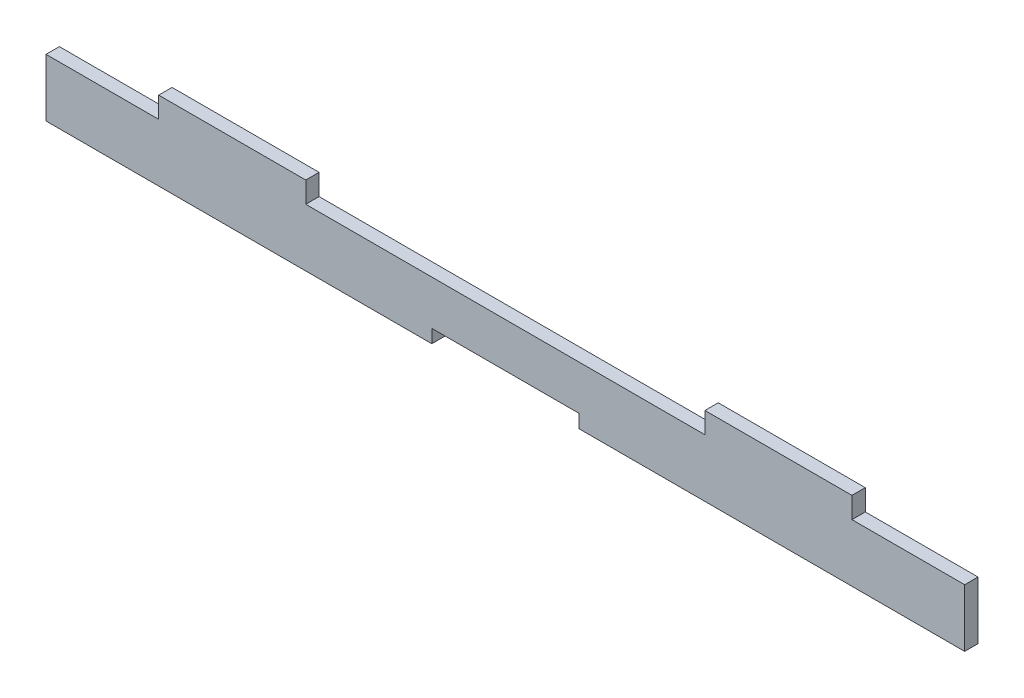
ISO-10303-21;
HEADER;
FILE_DESCRIPTION(('STEP AP214'),'2;1');
FILE_NAME('part.step','',(''),(''),'','','');
FILE_SCHEMA(('AUTOMOTIVE_DESIGN { 1 0 10303 214 1 1 1 1 }'));
ENDSEC;
DATA;
#1=APPLICATION_CONTEXT('core data for automotive mechanical design processes');
#2=APPLICATION_PROTOCOL_DEFINITION('international standard','automotive_design',2000,#1);
#3=PRODUCT_CONTEXT('',#1,'mechanical');
#4=PRODUCT('Part','Part','',(#3));
#5=PRODUCT_RELATED_PRODUCT_CATEGORY('part','',(#4));
#6=PRODUCT_DEFINITION_FORMATION('','',#4);
#7=PRODUCT_DEFINITION_CONTEXT('part definition',#1,'design');
#8=PRODUCT_DEFINITION('design','',#6,#7);
#9=PRODUCT_DEFINITION_SHAPE('','',#8);
#10=(LENGTH_UNIT() NAMED_UNIT(*) SI_UNIT(.MILLI.,.METRE.));
#11=(NAMED_UNIT(*) PLANE_ANGLE_UNIT() SI_UNIT($,.RADIAN.));
#12=(NAMED_UNIT(*) SI_UNIT($,.STERADIAN.) SOLID_ANGLE_UNIT());
#13=UNCERTAINTY_MEASURE_WITH_UNIT(LENGTH_MEASURE(1.E-05),#10,'distance_accuracy_value','');
#14=(GEOMETRIC_REPRESENTATION_CONTEXT(3) GLOBAL_UNCERTAINTY_ASSIGNED_CONTEXT((#13)) GLOBAL_UNIT_ASSIGNED_CONTEXT((#10,
#11,#12)) REPRESENTATION_CONTEXT('',''));
#15=CARTESIAN_POINT('',(0.,0.,0.));
#16=DIRECTION('',(0.,0.,1.));
#17=DIRECTION('',(1.,0.,0.));
#18=AXIS2_PLACEMENT_3D('',#15,#16,#17);
#19=CARTESIAN_POINT('',(-35.,-13.75,6.35));
#20=DIRECTION('',(-1.,0.,0.));
#21=DIRECTION('',(0.,0.,1.));
#22=AXIS2_PLACEMENT_3D('',#19,#20,#21);
#23=PLANE('',#22);
#24=DIRECTION('',(0.,1.,0.));
#25=VECTOR('',#24,1.);
#26=CARTESIAN_POINT('',(-35.,-13.75,0.));
#27=LINE('',#26,#25);
#28=CARTESIAN_POINT('',(-35.,-13.75,0.));
#29=VERTEX_POINT('',#28);
#30=CARTESIAN_POINT('',(-35.,-7.39999999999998,0.));
#31=VERTEX_POINT('',#30);
#32=EDGE_CURVE('E181',#29,#31,#27,.T.);
#33=ORIENTED_EDGE('',*,*,#32,.T.);
#34=DIRECTION('',(0.,0.,-1.));
#35=VECTOR('',#34,1.);
#36=CARTESIAN_POINT('',(-35.,-7.39999999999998,6.35));
#37=LINE('',#36,#35);
#38=CARTESIAN_POINT('',(-35.,-7.39999999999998,6.35));
#39=VERTEX_POINT('',#38);
#40=EDGE_CURVE('E11',#39,#31,#37,.T.);
#41=ORIENTED_EDGE('',*,*,#40,.F.);
#42=DIRECTION('',(0.,1.,0.));
#43=VECTOR('',#42,1.);
#44=CARTESIAN_POINT('',(-35.,-13.75,6.35));
#45=LINE('',#44,#43);
#46=CARTESIAN_POINT('',(-35.,-13.75,6.35));
#47=VERTEX_POINT('',#46);
#48=EDGE_CURVE('E211',#47,#39,#45,.T.);
#49=ORIENTED_EDGE('',*,*,#48,.F.);
#50=DIRECTION('',(0.,0.,-1.));
#51=VECTOR('',#50,1.);
#52=CARTESIAN_POINT('',(-35.,-13.75,6.35));
#53=LINE('',#52,#51);
#54=EDGE_CURVE('E177',#47,#29,#53,.T.);
#55=ORIENTED_EDGE('',*,*,#54,.T.);
#56=EDGE_LOOP('',(#33,#41,#49,#55));
#57=FACE_BOUND('',#56,.T.);
#58=ADVANCED_FACE('F37',(#57),#23,.F.);
#59=CARTESIAN_POINT('',(-35.,-7.39999999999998,6.35));
#60=DIRECTION('',(0.,1.,0.));
#61=DIRECTION('',(-1.,0.,0.));
#62=AXIS2_PLACEMENT_3D('',#59,#60,#61);
#63=PLANE('',#62);
#64=DIRECTION('',(1.,0.,0.));
#65=VECTOR('',#64,1.);
#66=CARTESIAN_POINT('',(-35.,-7.39999999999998,0.));
#67=LINE('',#66,#65);
#68=CARTESIAN_POINT('',(35.,-7.39999999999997,0.));
#69=VERTEX_POINT('',#68);
#70=EDGE_CURVE('E184',#31,#69,#67,.T.);
#71=ORIENTED_EDGE('',*,*,#70,.T.);
#72=DIRECTION('',(0.,0.,-1.));
#73=VECTOR('',#72,1.);
#74=CARTESIAN_POINT('',(35.,-7.39999999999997,6.35));
#75=LINE('',#74,#73);
#76=CARTESIAN_POINT('',(35.,-7.39999999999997,6.35));
#77=VERTEX_POINT('',#76);
#78=EDGE_CURVE('E45',#77,#69,#75,.T.);
#79=ORIENTED_EDGE('',*,*,#78,.F.);
#80=DIRECTION('',(1.,0.,0.));
#81=VECTOR('',#80,1.);
#82=CARTESIAN_POINT('',(-35.,-7.39999999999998,6.35));
#83=LINE('',#82,#81);
#84=EDGE_CURVE('E120',#39,#77,#83,.T.);
#85=ORIENTED_EDGE('',*,*,#84,.F.);
#86=ORIENTED_EDGE('',*,*,#40,.T.);
#87=EDGE_LOOP('',(#71,#79,#85,#86));
#88=FACE_BOUND('',#87,.T.);
#89=ADVANCED_FACE('F309',(#88),#63,.F.);
#90=CARTESIAN_POINT('',(35.,-13.75,6.35));
#91=DIRECTION('',(1.,0.,0.));
#92=DIRECTION('',(0.,0.,-1.));
#93=AXIS2_PLACEMENT_3D('',#90,#91,#92);
#94=PLANE('',#93);
#95=DIRECTION('',(0.,-1.,0.));
#96=VECTOR('',#95,1.);
#97=CARTESIAN_POINT('',(35.,-13.75,0.));
#98=LINE('',#97,#96);
#99=CARTESIAN_POINT('',(35.,-13.75,0.));
#100=VERTEX_POINT('',#99);
#101=EDGE_CURVE('E186',#69,#100,#98,.T.);
#102=ORIENTED_EDGE('',*,*,#101,.T.);
#103=DIRECTION('',(0.,0.,-1.));
#104=VECTOR('',#103,1.);
#105=CARTESIAN_POINT('',(35.,-13.75,6.35));
#106=LINE('',#105,#104);
#107=CARTESIAN_POINT('',(35.,-13.75,6.35));
#108=VERTEX_POINT('',#107);
#109=EDGE_CURVE('E242',#108,#100,#106,.T.);
#110=ORIENTED_EDGE('',*,*,#109,.F.);
#111=DIRECTION('',(0.,-1.,0.));
#112=VECTOR('',#111,1.);
#113=CARTESIAN_POINT('',(35.,-13.75,6.35));
#114=LINE('',#113,#112);
#115=EDGE_CURVE('E250',#77,#108,#114,.T.);
#116=ORIENTED_EDGE('',*,*,#115,.F.);
#117=ORIENTED_EDGE('',*,*,#78,.T.);
#118=EDGE_LOOP('',(#102,#110,#116,#117));
#119=FACE_BOUND('',#118,.T.);
#120=ADVANCED_FACE('F248',(#119),#94,.F.);
#121=CARTESIAN_POINT('',(35.,-13.75,6.35));
#122=DIRECTION('',(0.,1.,0.));
#123=DIRECTION('',(0.,0.,1.));
#124=AXIS2_PLACEMENT_3D('',#121,#122,#123);
#125=PLANE('',#124);
#126=DIRECTION('',(1.,0.,0.));
#127=VECTOR('',#126,1.);
#128=CARTESIAN_POINT('',(35.,-13.75,0.));
#129=LINE('',#128,#127);
#130=CARTESIAN_POINT('',(218.65,-13.75,0.));
#131=VERTEX_POINT('',#130);
#132=EDGE_CURVE('E188',#100,#131,#129,.T.);
#133=ORIENTED_EDGE('',*,*,#132,.T.);
#134=DIRECTION('',(0.,0.,-1.));
#135=VECTOR('',#134,1.);
#136=CARTESIAN_POINT('',(218.65,-13.75,6.35));
#137=LINE('',#136,#135);
#138=CARTESIAN_POINT('',(218.65,-13.75,6.35));
#139=VERTEX_POINT('',#138);
#140=EDGE_CURVE('E239',#139,#131,#137,.T.);
#141=ORIENTED_EDGE('',*,*,#140,.F.);
#142=DIRECTION('',(1.,0.,0.));
#143=VECTOR('',#142,1.);
#144=CARTESIAN_POINT('',(35.,-13.75,6.35));
#145=LINE('',#144,#143);
#146=EDGE_CURVE('E268',#108,#139,#145,.T.);
#147=ORIENTED_EDGE('',*,*,#146,.F.);
#148=ORIENTED_EDGE('',*,*,#109,.T.);
#149=EDGE_LOOP('',(#133,#141,#147,#148));
#150=FACE_BOUND('',#149,.T.);
#151=ADVANCED_FACE('F259',(#150),#125,.F.);
#152=CARTESIAN_POINT('',(218.65,13.75,6.35));
#153=DIRECTION('',(-1.,0.,0.));
#154=DIRECTION('',(0.,0.,1.));
#155=AXIS2_PLACEMENT_3D('',#152,#153,#154);
#156=PLANE('',#155);
#157=DIRECTION('',(0.,1.,0.));
#158=VECTOR('',#157,1.);
#159=CARTESIAN_POINT('',(218.65,13.75,0.));
#160=LINE('',#159,#158);
#161=CARTESIAN_POINT('',(218.65,13.75,0.));
#162=VERTEX_POINT('',#161);
#163=EDGE_CURVE('E190',#131,#162,#160,.T.);
#164=ORIENTED_EDGE('',*,*,#163,.T.);
#165=DIRECTION('',(0.,0.,-1.));
#166=VECTOR('',#165,1.);
#167=CARTESIAN_POINT('',(218.65,13.75,6.35));
#168=LINE('',#167,#166);
#169=CARTESIAN_POINT('',(218.65,13.75,6.35));
#170=VERTEX_POINT('',#169);
#171=EDGE_CURVE('E236',#170,#162,#168,.T.);
#172=ORIENTED_EDGE('',*,*,#171,.F.);
#173=DIRECTION('',(0.,1.,0.));
#174=VECTOR('',#173,1.);
#175=CARTESIAN_POINT('',(218.65,13.75,6.35));
#176=LINE('',#175,#174);
#177=EDGE_CURVE('E265',#139,#170,#176,.T.);
#178=ORIENTED_EDGE('',*,*,#177,.F.);
#179=ORIENTED_EDGE('',*,*,#140,.T.);
#180=EDGE_LOOP('',(#164,#172,#178,#179));
#181=FACE_BOUND('',#180,.T.);
#182=ADVANCED_FACE('F263',(#181),#156,.F.);
#183=CARTESIAN_POINT('',(165.,13.75,6.35));
#184=DIRECTION('',(0.,-1.,0.));
#185=DIRECTION('',(0.,0.,-1.));
#186=AXIS2_PLACEMENT_3D('',#183,#184,#185);
#187=PLANE('',#186);
#188=DIRECTION('',(-1.,0.,0.));
#189=VECTOR('',#188,1.);
#190=CARTESIAN_POINT('',(165.,13.75,0.));
#191=LINE('',#190,#189);
#192=CARTESIAN_POINT('',(165.,13.75,0.));
#193=VERTEX_POINT('',#192);
#194=EDGE_CURVE('E192',#162,#193,#191,.T.);
#195=ORIENTED_EDGE('',*,*,#194,.T.);
#196=DIRECTION('',(0.,0.,-1.));
#197=VECTOR('',#196,1.);
#198=CARTESIAN_POINT('',(165.,13.75,6.35));
#199=LINE('',#198,#197);
#200=CARTESIAN_POINT('',(165.,13.75,6.35));
#201=VERTEX_POINT('',#200);
#202=EDGE_CURVE('E233',#201,#193,#199,.T.);
#203=ORIENTED_EDGE('',*,*,#202,.F.);
#204=DIRECTION('',(-1.,0.,0.));
#205=VECTOR('',#204,1.);
#206=CARTESIAN_POINT('',(165.,13.75,6.35));
#207=LINE('',#206,#205);
#208=EDGE_CURVE('E267',#170,#201,#207,.T.);
#209=ORIENTED_EDGE('',*,*,#208,.F.);
#210=ORIENTED_EDGE('',*,*,#171,.T.);
#211=EDGE_LOOP('',(#195,#203,#209,#210));
#212=FACE_BOUND('',#211,.T.);
#213=ADVANCED_FACE('F322',(#212),#187,.F.);
#214=CARTESIAN_POINT('',(165.,13.75,6.35));
#215=DIRECTION('',(-1.,0.,0.));
#216=DIRECTION('',(0.,-1.,0.));
#217=AXIS2_PLACEMENT_3D('',#214,#215,#216);
#218=PLANE('',#217);
#219=DIRECTION('',(0.,1.,0.));
#220=VECTOR('',#219,1.);
#221=CARTESIAN_POINT('',(165.,13.75,0.));
#222=LINE('',#221,#220);
#223=CARTESIAN_POINT('',(165.,23.75,0.));
#224=VERTEX_POINT('',#223);
#225=EDGE_CURVE('E194',#193,#224,#222,.T.);
#226=ORIENTED_EDGE('',*,*,#225,.T.);
#227=DIRECTION('',(0.,0.,-1.));
#228=VECTOR('',#227,1.);
#229=CARTESIAN_POINT('',(165.,23.75,6.35));
#230=LINE('',#229,#228);
#231=CARTESIAN_POINT('',(165.,23.75,6.35));
#232=VERTEX_POINT('',#231);
#233=EDGE_CURVE('E230',#232,#224,#230,.T.);
#234=ORIENTED_EDGE('',*,*,#233,.F.);
#235=DIRECTION('',(0.,1.,0.));
#236=VECTOR('',#235,1.);
#237=CARTESIAN_POINT('',(165.,13.75,6.35));
#238=LINE('',#237,#236);
#239=EDGE_CURVE('E270',#201,#232,#238,.T.);
#240=ORIENTED_EDGE('',*,*,#239,.F.);
#241=ORIENTED_EDGE('',*,*,#202,.T.);
#242=EDGE_LOOP('',(#226,#234,#240,#241));
#243=FACE_BOUND('',#242,.T.);
#244=ADVANCED_FACE('F325',(#243),#218,.F.);
#245=CARTESIAN_POINT('',(95.,23.75,6.35));
#246=DIRECTION('',(0.,-1.,0.));
#247=DIRECTION('',(0.,0.,-1.));
#248=AXIS2_PLACEMENT_3D('',#245,#246,#247);
#249=PLANE('',#248);
#250=DIRECTION('',(-1.,0.,0.));
#251=VECTOR('',#250,1.);
#252=CARTESIAN_POINT('',(95.,23.75,0.));
#253=LINE('',#252,#251);
#254=CARTESIAN_POINT('',(95.,23.75,0.));
#255=VERTEX_POINT('',#254);
#256=EDGE_CURVE('E196',#224,#255,#253,.T.);
#257=ORIENTED_EDGE('',*,*,#256,.T.);
#258=DIRECTION('',(0.,0.,-1.));
#259=VECTOR('',#258,1.);
#260=CARTESIAN_POINT('',(95.,23.75,6.35));
#261=LINE('',#260,#259);
#262=CARTESIAN_POINT('',(95.,23.75,6.35));
#263=VERTEX_POINT('',#262);
#264=EDGE_CURVE('E227',#263,#255,#261,.T.);
#265=ORIENTED_EDGE('',*,*,#264,.F.);
#266=DIRECTION('',(-1.,0.,0.));
#267=VECTOR('',#266,1.);
#268=CARTESIAN_POINT('',(95.,23.75,6.35));
#269=LINE('',#268,#267);
#270=EDGE_CURVE('E276',#232,#263,#269,.T.);
#271=ORIENTED_EDGE('',*,*,#270,.F.);
#272=ORIENTED_EDGE('',*,*,#233,.T.);
#273=EDGE_LOOP('',(#257,#265,#271,#272));
#274=FACE_BOUND('',#273,.T.);
#275=ADVANCED_FACE('F329',(#274),#249,.F.);
#276=CARTESIAN_POINT('',(95.,13.75,6.35));
#277=DIRECTION('',(1.,0.,0.));
#278=DIRECTION('',(0.,0.,-1.));
#279=AXIS2_PLACEMENT_3D('',#276,#277,#278);
#280=PLANE('',#279);
#281=DIRECTION('',(0.,-1.,0.));
#282=VECTOR('',#281,1.);
#283=CARTESIAN_POINT('',(95.,13.75,0.));
#284=LINE('',#283,#282);
#285=CARTESIAN_POINT('',(95.,13.75,0.));
#286=VERTEX_POINT('',#285);
#287=EDGE_CURVE('E198',#255,#286,#284,.T.);
#288=ORIENTED_EDGE('',*,*,#287,.T.);
#289=DIRECTION('',(0.,0.,-1.));
#290=VECTOR('',#289,1.);
#291=CARTESIAN_POINT('',(95.,13.75,6.35));
#292=LINE('',#291,#290);
#293=CARTESIAN_POINT('',(95.,13.75,6.35));
#294=VERTEX_POINT('',#293);
#295=EDGE_CURVE('E224',#294,#286,#292,.T.);
#296=ORIENTED_EDGE('',*,*,#295,.F.);
#297=DIRECTION('',(0.,-1.,0.));
#298=VECTOR('',#297,1.);
#299=CARTESIAN_POINT('',(95.,13.75,6.35));
#300=LINE('',#299,#298);
#301=EDGE_CURVE('E278',#263,#294,#300,.T.);
#302=ORIENTED_EDGE('',*,*,#301,.F.);
#303=ORIENTED_EDGE('',*,*,#264,.T.);
#304=EDGE_LOOP('',(#288,#296,#302,#303));
#305=FACE_BOUND('',#304,.T.);
#306=ADVANCED_FACE('F333',(#305),#280,.F.);
#307=CARTESIAN_POINT('',(-95.,13.75,6.35));
#308=DIRECTION('',(0.,-1.,0.));
#309=DIRECTION('',(0.,0.,-1.));
#310=AXIS2_PLACEMENT_3D('',#307,#308,#309);
#311=PLANE('',#310);
#312=DIRECTION('',(-1.,0.,0.));
#313=VECTOR('',#312,1.);
#314=CARTESIAN_POINT('',(-95.,13.75,0.));
#315=LINE('',#314,#313);
#316=CARTESIAN_POINT('',(-95.,13.75,0.));
#317=VERTEX_POINT('',#316);
#318=EDGE_CURVE('E200',#286,#317,#315,.T.);
#319=ORIENTED_EDGE('',*,*,#318,.T.);
#320=DIRECTION('',(0.,0.,-1.));
#321=VECTOR('',#320,1.);
#322=CARTESIAN_POINT('',(-95.,13.75,6.35));
#323=LINE('',#322,#321);
#324=CARTESIAN_POINT('',(-95.,13.75,6.35));
#325=VERTEX_POINT('',#324);
#326=EDGE_CURVE('E221',#325,#317,#323,.T.);
#327=ORIENTED_EDGE('',*,*,#326,.F.);
#328=DIRECTION('',(-1.,0.,0.));
#329=VECTOR('',#328,1.);
#330=CARTESIAN_POINT('',(-95.,13.75,6.35));
#331=LINE('',#330,#329);
#332=EDGE_CURVE('E280',#294,#325,#331,.T.);
#333=ORIENTED_EDGE('',*,*,#332,.F.);
#334=ORIENTED_EDGE('',*,*,#295,.T.);
#335=EDGE_LOOP('',(#319,#327,#333,#334));
#336=FACE_BOUND('',#335,.T.);
#337=ADVANCED_FACE('F337',(#336),#311,.F.);
#338=CARTESIAN_POINT('',(-95.,13.75,6.35));
#339=DIRECTION('',(-1.,0.,0.));
#340=DIRECTION('',(0.,0.,1.));
#341=AXIS2_PLACEMENT_3D('',#338,#339,#340);
#342=PLANE('',#341);
#343=DIRECTION('',(0.,1.,0.));
#344=VECTOR('',#343,1.);
#345=CARTESIAN_POINT('',(-95.,13.75,0.));
#346=LINE('',#345,#344);
#347=CARTESIAN_POINT('',(-95.,23.75,0.));
#348=VERTEX_POINT('',#347);
#349=EDGE_CURVE('E202',#317,#348,#346,.T.);
#350=ORIENTED_EDGE('',*,*,#349,.T.);
#351=DIRECTION('',(0.,0.,-1.));
#352=VECTOR('',#351,1.);
#353=CARTESIAN_POINT('',(-95.,23.75,6.35));
#354=LINE('',#353,#352);
#355=CARTESIAN_POINT('',(-95.,23.75,6.35));
#356=VERTEX_POINT('',#355);
#357=EDGE_CURVE('E218',#356,#348,#354,.T.);
#358=ORIENTED_EDGE('',*,*,#357,.F.);
#359=DIRECTION('',(0.,1.,0.));
#360=VECTOR('',#359,1.);
#361=CARTESIAN_POINT('',(-95.,13.75,6.35));
#362=LINE('',#361,#360);
#363=EDGE_CURVE('E282',#325,#356,#362,.T.);
#364=ORIENTED_EDGE('',*,*,#363,.F.);
#365=ORIENTED_EDGE('',*,*,#326,.T.);
#366=EDGE_LOOP('',(#350,#358,#364,#365));
#367=FACE_BOUND('',#366,.T.);
#368=ADVANCED_FACE('F341',(#367),#342,.F.);
#369=CARTESIAN_POINT('',(-165.,23.75,6.35));
#370=DIRECTION('',(0.,-1.,0.));
#371=DIRECTION('',(0.,0.,-1.));
#372=AXIS2_PLACEMENT_3D('',#369,#370,#371);
#373=PLANE('',#372);
#374=DIRECTION('',(-1.,0.,0.));
#375=VECTOR('',#374,1.);
#376=CARTESIAN_POINT('',(-165.,23.75,0.));
#377=LINE('',#376,#375);
#378=CARTESIAN_POINT('',(-165.,23.75,0.));
#379=VERTEX_POINT('',#378);
#380=EDGE_CURVE('E204',#348,#379,#377,.T.);
#381=ORIENTED_EDGE('',*,*,#380,.T.);
#382=DIRECTION('',(0.,0.,-1.));
#383=VECTOR('',#382,1.);
#384=CARTESIAN_POINT('',(-165.,23.75,6.35));
#385=LINE('',#384,#383);
#386=CARTESIAN_POINT('',(-165.,23.75,6.35));
#387=VERTEX_POINT('',#386);
#388=EDGE_CURVE('E215',#387,#379,#385,.T.);
#389=ORIENTED_EDGE('',*,*,#388,.F.);
#390=DIRECTION('',(-1.,0.,0.));
#391=VECTOR('',#390,1.);
#392=CARTESIAN_POINT('',(-165.,23.75,6.35));
#393=LINE('',#392,#391);
#394=EDGE_CURVE('E284',#356,#387,#393,.T.);
#395=ORIENTED_EDGE('',*,*,#394,.F.);
#396=ORIENTED_EDGE('',*,*,#357,.T.);
#397=EDGE_LOOP('',(#381,#389,#395,#396));
#398=FACE_BOUND('',#397,.T.);
#399=ADVANCED_FACE('F290',(#398),#373,.F.);
#400=CARTESIAN_POINT('',(-165.,13.75,6.35));
#401=DIRECTION('',(1.,0.,0.));
#402=DIRECTION('',(0.,1.,0.));
#403=AXIS2_PLACEMENT_3D('',#400,#401,#402);
#404=PLANE('',#403);
#405=DIRECTION('',(0.,-1.,0.));
#406=VECTOR('',#405,1.);
#407=CARTESIAN_POINT('',(-165.,13.75,0.));
#408=LINE('',#407,#406);
#409=CARTESIAN_POINT('',(-165.,13.75,0.));
#410=VERTEX_POINT('',#409);
#411=EDGE_CURVE('E206',#379,#410,#408,.T.);
#412=ORIENTED_EDGE('',*,*,#411,.T.);
#413=DIRECTION('',(0.,0.,-1.));
#414=VECTOR('',#413,1.);
#415=CARTESIAN_POINT('',(-165.,13.75,6.35));
#416=LINE('',#415,#414);
#417=CARTESIAN_POINT('',(-165.,13.75,6.35));
#418=VERTEX_POINT('',#417);
#419=EDGE_CURVE('E172',#418,#410,#416,.T.);
#420=ORIENTED_EDGE('',*,*,#419,.F.);
#421=DIRECTION('',(0.,-1.,0.));
#422=VECTOR('',#421,1.);
#423=CARTESIAN_POINT('',(-165.,13.75,6.35));
#424=LINE('',#423,#422);
#425=EDGE_CURVE('E163',#387,#418,#424,.T.);
#426=ORIENTED_EDGE('',*,*,#425,.F.);
#427=ORIENTED_EDGE('',*,*,#388,.T.);
#428=EDGE_LOOP('',(#412,#420,#426,#427));
#429=FACE_BOUND('',#428,.T.);
#430=ADVANCED_FACE('F294',(#429),#404,.F.);
#431=CARTESIAN_POINT('',(-218.65,13.75,6.35));
#432=DIRECTION('',(0.,-1.,0.));
#433=DIRECTION('',(1.,0.,0.));
#434=AXIS2_PLACEMENT_3D('',#431,#432,#433);
#435=PLANE('',#434);
#436=DIRECTION('',(-1.,0.,0.));
#437=VECTOR('',#436,1.);
#438=CARTESIAN_POINT('',(-218.65,13.75,0.));
#439=LINE('',#438,#437);
#440=CARTESIAN_POINT('',(-218.65,13.75,0.));
#441=VERTEX_POINT('',#440);
#442=EDGE_CURVE('E171',#410,#441,#439,.T.);
#443=ORIENTED_EDGE('',*,*,#442,.T.);
#444=DIRECTION('',(0.,0.,-1.));
#445=VECTOR('',#444,1.);
#446=CARTESIAN_POINT('',(-218.65,13.75,6.35));
#447=LINE('',#446,#445);
#448=CARTESIAN_POINT('',(-218.65,13.75,6.35));
#449=VERTEX_POINT('',#448);
#450=EDGE_CURVE('E168',#449,#441,#447,.T.);
#451=ORIENTED_EDGE('',*,*,#450,.F.);
#452=DIRECTION('',(-1.,0.,0.));
#453=VECTOR('',#452,1.);
#454=CARTESIAN_POINT('',(-218.65,13.75,6.35));
#455=LINE('',#454,#453);
#456=EDGE_CURVE('E157',#418,#449,#455,.T.);
#457=ORIENTED_EDGE('',*,*,#456,.F.);
#458=ORIENTED_EDGE('',*,*,#419,.T.);
#459=EDGE_LOOP('',(#443,#451,#457,#458));
#460=FACE_BOUND('',#459,.T.);
#461=ADVANCED_FACE('F169',(#460),#435,.F.);
#462=CARTESIAN_POINT('',(-218.65,13.75,6.35));
#463=DIRECTION('',(1.,0.,0.));
#464=DIRECTION('',(0.,0.,-1.));
#465=AXIS2_PLACEMENT_3D('',#462,#463,#464);
#466=PLANE('',#465);
#467=DIRECTION('',(0.,-1.,0.));
#468=VECTOR('',#467,1.);
#469=CARTESIAN_POINT('',(-218.65,13.75,0.));
#470=LINE('',#469,#468);
#471=CARTESIAN_POINT('',(-218.65,-13.75,0.));
#472=VERTEX_POINT('',#471);
#473=EDGE_CURVE('E106',#441,#472,#470,.T.);
#474=ORIENTED_EDGE('',*,*,#473,.T.);
#475=DIRECTION('',(0.,0.,-1.));
#476=VECTOR('',#475,1.);
#477=CARTESIAN_POINT('',(-218.65,-13.75,6.35));
#478=LINE('',#477,#476);
#479=CARTESIAN_POINT('',(-218.65,-13.75,6.35));
#480=VERTEX_POINT('',#479);
#481=EDGE_CURVE('E173',#480,#472,#478,.T.);
#482=ORIENTED_EDGE('',*,*,#481,.F.);
#483=DIRECTION('',(0.,-1.,0.));
#484=VECTOR('',#483,1.);
#485=CARTESIAN_POINT('',(-218.65,13.75,6.35));
#486=LINE('',#485,#484);
#487=EDGE_CURVE('E161',#449,#480,#486,.T.);
#488=ORIENTED_EDGE('',*,*,#487,.F.);
#489=ORIENTED_EDGE('',*,*,#450,.T.);
#490=EDGE_LOOP('',(#474,#482,#488,#489));
#491=FACE_BOUND('',#490,.T.);
#492=ADVANCED_FACE('F175',(#491),#466,.F.);
#493=CARTESIAN_POINT('',(-218.65,-13.75,6.35));
#494=DIRECTION('',(0.,1.,0.));
#495=DIRECTION('',(-1.,0.,0.));
#496=AXIS2_PLACEMENT_3D('',#493,#494,#495);
#497=PLANE('',#496);
#498=DIRECTION('',(1.,0.,0.));
#499=VECTOR('',#498,1.);
#500=CARTESIAN_POINT('',(-218.65,-13.75,0.));
#501=LINE('',#500,#499);
#502=EDGE_CURVE('E112',#472,#29,#501,.T.);
#503=ORIENTED_EDGE('',*,*,#502,.T.);
#504=ORIENTED_EDGE('',*,*,#54,.F.);
#505=DIRECTION('',(1.,0.,0.));
#506=VECTOR('',#505,1.);
#507=CARTESIAN_POINT('',(-218.65,-13.75,6.35));
#508=LINE('',#507,#506);
#509=EDGE_CURVE('E53',#480,#47,#508,.T.);
#510=ORIENTED_EDGE('',*,*,#509,.F.);
#511=ORIENTED_EDGE('',*,*,#481,.T.);
#512=EDGE_LOOP('',(#503,#504,#510,#511));
#513=FACE_BOUND('',#512,.T.);
#514=ADVANCED_FACE('F298',(#513),#497,.F.);
#515=CARTESIAN_POINT('',(0.,0.,6.35));
#516=DIRECTION('',(0.,0.,-1.));
#517=DIRECTION('',(-1.,0.,0.));
#518=AXIS2_PLACEMENT_3D('',#515,#516,#517);
#519=PLANE('',#518);
#520=ORIENTED_EDGE('',*,*,#48,.T.);
#521=ORIENTED_EDGE('',*,*,#84,.T.);
#522=ORIENTED_EDGE('',*,*,#115,.T.);
#523=ORIENTED_EDGE('',*,*,#146,.T.);
#524=ORIENTED_EDGE('',*,*,#177,.T.);
#525=ORIENTED_EDGE('',*,*,#208,.T.);
#526=ORIENTED_EDGE('',*,*,#239,.T.);
#527=ORIENTED_EDGE('',*,*,#270,.T.);
#528=ORIENTED_EDGE('',*,*,#301,.T.);
#529=ORIENTED_EDGE('',*,*,#332,.T.);
#530=ORIENTED_EDGE('',*,*,#363,.T.);
#531=ORIENTED_EDGE('',*,*,#394,.T.);
#532=ORIENTED_EDGE('',*,*,#425,.T.);
#533=ORIENTED_EDGE('',*,*,#456,.T.);
#534=ORIENTED_EDGE('',*,*,#487,.T.);
#535=ORIENTED_EDGE('',*,*,#509,.T.);
#536=EDGE_LOOP('',(#520,#521,#522,#523,#524,#525,#526,#527,#528,#529,#530,#531,#532,#533,#534,#535));
#537=FACE_BOUND('',#536,.T.);
#538=ADVANCED_FACE('F159',(#537),#519,.F.);
#539=CARTESIAN_POINT('',(0.,0.,0.));
#540=DIRECTION('',(0.,0.,-1.));
#541=DIRECTION('',(-1.,0.,0.));
#542=AXIS2_PLACEMENT_3D('',#539,#540,#541);
#543=PLANE('',#542);
#544=ORIENTED_EDGE('',*,*,#32,.F.);
#545=ORIENTED_EDGE('',*,*,#502,.F.);
#546=ORIENTED_EDGE('',*,*,#473,.F.);
#547=ORIENTED_EDGE('',*,*,#442,.F.);
#548=ORIENTED_EDGE('',*,*,#411,.F.);
#549=ORIENTED_EDGE('',*,*,#380,.F.);
#550=ORIENTED_EDGE('',*,*,#349,.F.);
#551=ORIENTED_EDGE('',*,*,#318,.F.);
#552=ORIENTED_EDGE('',*,*,#287,.F.);
#553=ORIENTED_EDGE('',*,*,#256,.F.);
#554=ORIENTED_EDGE('',*,*,#225,.F.);
#555=ORIENTED_EDGE('',*,*,#194,.F.);
#556=ORIENTED_EDGE('',*,*,#163,.F.);
#557=ORIENTED_EDGE('',*,*,#132,.F.);
#558=ORIENTED_EDGE('',*,*,#101,.F.);
#559=ORIENTED_EDGE('',*,*,#70,.F.);
#560=EDGE_LOOP('',(#544,#545,#546,#547,#548,#549,#550,#551,#552,#553,#554,#555,#556,#557,#558,#559));
#561=FACE_BOUND('',#560,.T.);
#562=ADVANCED_FACE('F254',(#561),#543,.T.);
#563=CLOSED_SHELL('',(#58,#89,#120,#151,#182,#213,#244,#275,#306,#337,#368,#399,#430,#461,#492,
#514,#538,#562));
#564=MANIFOLD_SOLID_BREP('B2',#563);
#565=ADVANCED_BREP_SHAPE_REPRESENTATION('',(#18,#564),#14);
#566=SHAPE_DEFINITION_REPRESENTATION(#9,#565);
ENDSEC;
END-ISO-10303-21;
